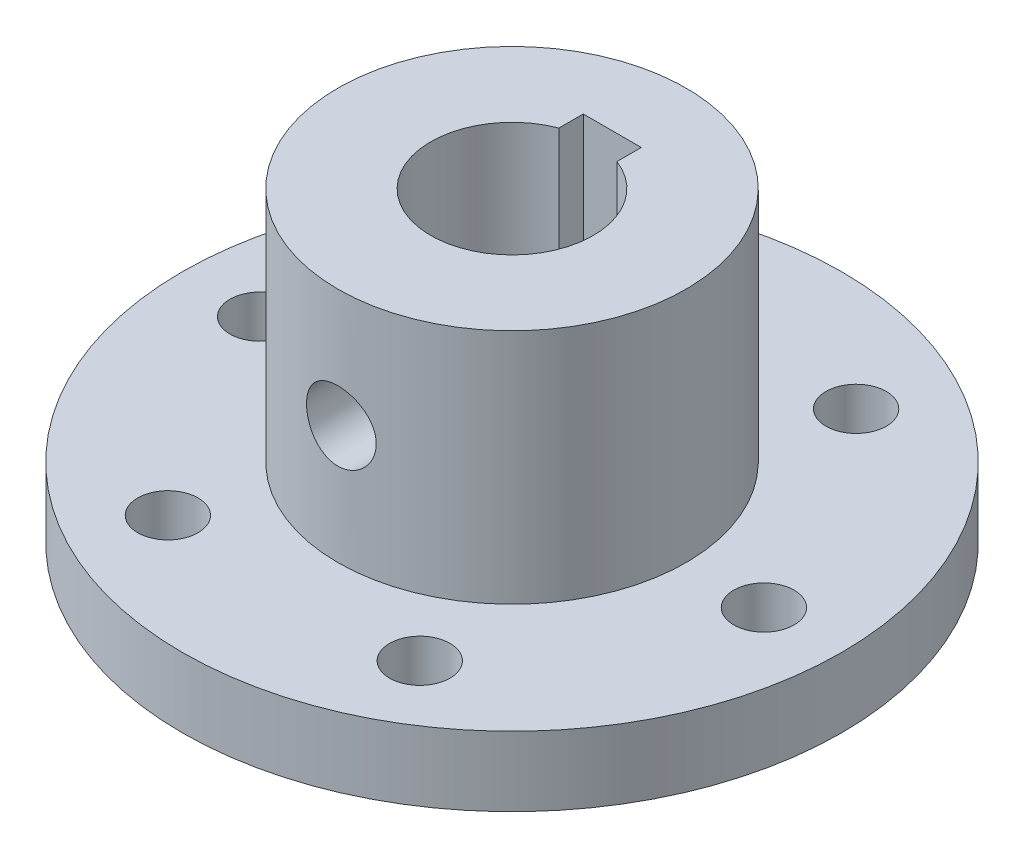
ISO-10303-21;
HEADER;
FILE_DESCRIPTION(('STEP AP214'),'2;1');
FILE_NAME('part.step','',(''),(''),'','','');
FILE_SCHEMA(('AUTOMOTIVE_DESIGN { 1 0 10303 214 1 1 1 1 }'));
ENDSEC;
DATA;
#1=APPLICATION_CONTEXT('core data for automotive mechanical design processes');
#2=APPLICATION_PROTOCOL_DEFINITION('international standard','automotive_design',2000,#1);
#3=PRODUCT_CONTEXT('',#1,'mechanical');
#4=PRODUCT('Part','Part','',(#3));
#5=PRODUCT_RELATED_PRODUCT_CATEGORY('part','',(#4));
#6=PRODUCT_DEFINITION_FORMATION('','',#4);
#7=PRODUCT_DEFINITION_CONTEXT('part definition',#1,'design');
#8=PRODUCT_DEFINITION('design','',#6,#7);
#9=PRODUCT_DEFINITION_SHAPE('','',#8);
#10=(LENGTH_UNIT() NAMED_UNIT(*) SI_UNIT(.MILLI.,.METRE.));
#11=(NAMED_UNIT(*) PLANE_ANGLE_UNIT() SI_UNIT($,.RADIAN.));
#12=(NAMED_UNIT(*) SI_UNIT($,.STERADIAN.) SOLID_ANGLE_UNIT());
#13=UNCERTAINTY_MEASURE_WITH_UNIT(LENGTH_MEASURE(1.E-05),#10,'distance_accuracy_value','');
#14=(GEOMETRIC_REPRESENTATION_CONTEXT(3) GLOBAL_UNCERTAINTY_ASSIGNED_CONTEXT((#13)) GLOBAL_UNIT_ASSIGNED_CONTEXT((#10,
#11,#12)) REPRESENTATION_CONTEXT('',''));
#15=CARTESIAN_POINT('',(0.,0.,0.));
#16=DIRECTION('',(0.,0.,1.));
#17=DIRECTION('',(1.,0.,0.));
#18=AXIS2_PLACEMENT_3D('',#15,#16,#17);
#19=CARTESIAN_POINT('',(0.,26.4,0.));
#20=DIRECTION('',(0.,-1.,0.));
#21=DIRECTION('',(0.,0.,-1.));
#22=AXIS2_PLACEMENT_3D('',#19,#20,#21);
#23=CYLINDRICAL_SURFACE('',#22,15.);
#24=CARTESIAN_POINT('',(0.,26.4,0.));
#25=DIRECTION('',(0.,1.,0.));
#26=DIRECTION('',(0.,0.,1.));
#27=AXIS2_PLACEMENT_3D('',#24,#25,#26);
#28=CIRCLE('',#27,15.);
#29=CARTESIAN_POINT('',(0.,26.4,15.));
#30=VERTEX_POINT('',#29);
#31=EDGE_CURVE('E145',#30,#30,#28,.T.);
#32=ORIENTED_EDGE('',*,*,#31,.F.);
#33=EDGE_LOOP('',(#32));
#34=FACE_BOUND('',#33,.T.);
#35=CARTESIAN_POINT('',(0.,6.,0.));
#36=DIRECTION('',(0.,1.,0.));
#37=DIRECTION('',(0.,0.,1.));
#38=AXIS2_PLACEMENT_3D('',#35,#36,#37);
#39=CIRCLE('',#38,15.);
#40=CARTESIAN_POINT('',(0.,6.,15.));
#41=VERTEX_POINT('',#40);
#42=EDGE_CURVE('E11',#41,#41,#39,.T.);
#43=ORIENTED_EDGE('',*,*,#42,.T.);
#44=EDGE_LOOP('',(#43));
#45=FACE_BOUND('',#44,.T.);
#46=CARTESIAN_POINT('',(-3.,16.2,14.6969384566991));
#47=CARTESIAN_POINT('',(-2.99999383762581,16.0333068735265,14.6969417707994));
#48=CARTESIAN_POINT('',(-2.98605951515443,15.86653613,14.6998052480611));
#49=CARTESIAN_POINT('',(-2.93073685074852,15.5377124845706,14.7109329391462));
#50=CARTESIAN_POINT('',(-2.88932654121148,15.3756634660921,14.7192014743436));
#51=CARTESIAN_POINT('',(-2.78038734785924,15.0610880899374,14.7401662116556));
#52=CARTESIAN_POINT('',(-2.71288444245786,14.9085524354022,14.7528580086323));
#53=CARTESIAN_POINT('',(-2.55374732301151,14.6169754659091,14.7812339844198));
#54=CARTESIAN_POINT('',(-2.46211445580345,14.4779333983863,14.7969179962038));
#55=CARTESIAN_POINT('',(-2.25593722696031,14.2153169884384,14.8297589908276));
#56=CARTESIAN_POINT('',(-2.14111696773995,14.0919612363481,14.8469321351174));
#57=CARTESIAN_POINT('',(-1.89242036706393,13.8661273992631,14.880674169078));
#58=CARTESIAN_POINT('',(-1.75854269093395,13.7636507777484,14.8972430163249));
#59=CARTESIAN_POINT('',(-1.47408406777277,13.5816359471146,14.9280838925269));
#60=CARTESIAN_POINT('',(-1.32336770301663,13.5023054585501,14.9423346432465));
#61=CARTESIAN_POINT('',(-1.01041245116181,13.3701751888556,14.9667521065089));
#62=CARTESIAN_POINT('',(-0.848174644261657,13.317372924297,14.9769192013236));
#63=CARTESIAN_POINT('',(-0.519050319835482,13.2404784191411,14.9919096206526));
#64=CARTESIAN_POINT('',(-0.352253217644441,13.216017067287,14.9968015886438));
#65=CARTESIAN_POINT('',(-0.0168557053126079,13.1953471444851,15.0009276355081));
#66=CARTESIAN_POINT('',(0.15174452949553,13.1991358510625,15.0001622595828));
#67=CARTESIAN_POINT('',(0.483426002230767,13.2345785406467,14.9931130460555));
#68=CARTESIAN_POINT('',(0.646551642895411,13.2658349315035,14.9869079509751));
#69=CARTESIAN_POINT('',(0.965194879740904,13.3546950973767,14.9697653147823));
#70=CARTESIAN_POINT('',(1.12071217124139,13.4122999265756,14.9588275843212));
#71=CARTESIAN_POINT('',(1.42085838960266,13.5525901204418,14.9333188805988));
#72=CARTESIAN_POINT('',(1.5654125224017,13.6354312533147,14.9187254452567));
#73=CARTESIAN_POINT('',(1.83871513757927,13.8237272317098,14.8875140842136));
#74=CARTESIAN_POINT('',(1.967461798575,13.9291846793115,14.8708959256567));
#75=CARTESIAN_POINT('',(2.20785429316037,14.1619008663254,14.8371289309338));
#76=CARTESIAN_POINT('',(2.31916294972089,14.2895075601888,14.8199758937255));
#77=CARTESIAN_POINT('',(2.51885547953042,14.5617493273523,14.7873471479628));
#78=CARTESIAN_POINT('',(2.60723891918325,14.7063847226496,14.7718714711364));
#79=CARTESIAN_POINT('',(2.75868844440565,15.0090624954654,14.7443414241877));
#80=CARTESIAN_POINT('',(2.82169994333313,15.167132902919,14.7322944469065));
#81=CARTESIAN_POINT('',(2.92017102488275,15.491913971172,14.7130942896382));
#82=CARTESIAN_POINT('',(2.95563419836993,15.6586235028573,14.7059404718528));
#83=CARTESIAN_POINT('',(2.99749801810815,15.9928945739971,14.6974643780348));
#84=CARTESIAN_POINT('',(3.00438557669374,16.160392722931,14.6960444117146));
#85=CARTESIAN_POINT('',(2.99021288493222,16.494144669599,14.6989345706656));
#86=CARTESIAN_POINT('',(2.96915421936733,16.6603985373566,14.7032443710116));
#87=CARTESIAN_POINT('',(2.90010662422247,16.9853059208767,14.7170169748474));
#88=CARTESIAN_POINT('',(2.8523778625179,17.1440170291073,14.7264299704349));
#89=CARTESIAN_POINT('',(2.73162310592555,17.4511898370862,14.7493046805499));
#90=CARTESIAN_POINT('',(2.65859502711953,17.5996506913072,14.7627667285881));
#91=CARTESIAN_POINT('',(2.48821242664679,17.8842393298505,14.7924421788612));
#92=CARTESIAN_POINT('',(2.39055323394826,18.0201811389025,14.8086891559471));
#93=CARTESIAN_POINT('',(2.17408671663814,18.2739249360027,14.8420117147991));
#94=CARTESIAN_POINT('',(2.05527721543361,18.3917250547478,14.8590873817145));
#95=CARTESIAN_POINT('',(1.79769682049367,18.6076876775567,14.8924603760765));
#96=CARTESIAN_POINT('',(1.65864749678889,18.70552096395,14.9087417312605));
#97=CARTESIAN_POINT('',(1.36580368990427,18.8764376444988,14.9384138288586));
#98=CARTESIAN_POINT('',(1.21200982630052,18.9495220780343,14.9518046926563));
#99=CARTESIAN_POINT('',(0.894908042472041,19.0683866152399,14.974118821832));
#100=CARTESIAN_POINT('',(0.731660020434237,19.1143215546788,14.9830673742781));
#101=CARTESIAN_POINT('',(0.399568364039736,19.1780737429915,14.9955970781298));
#102=CARTESIAN_POINT('',(0.230725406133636,19.195894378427,14.9991788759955));
#103=CARTESIAN_POINT('',(-0.104618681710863,19.2027809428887,15.0005562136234));
#104=CARTESIAN_POINT('',(-0.271109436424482,19.1923418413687,14.9984513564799));
#105=CARTESIAN_POINT('',(-0.599913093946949,19.1440981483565,14.9889013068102));
#106=CARTESIAN_POINT('',(-0.762226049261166,19.1062939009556,14.9814561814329));
#107=CARTESIAN_POINT('',(-1.07775824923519,19.0046130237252,14.9620649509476));
#108=CARTESIAN_POINT('',(-1.23099732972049,18.9407958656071,14.9501291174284));
#109=CARTESIAN_POINT('',(-1.52466366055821,18.7889632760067,14.9230416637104));
#110=CARTESIAN_POINT('',(-1.66508989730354,18.7009459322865,14.9078897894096));
#111=CARTESIAN_POINT('',(-1.93159167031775,18.5015418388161,14.8757279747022));
#112=CARTESIAN_POINT('',(-2.05739914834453,18.3898009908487,14.858692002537));
#113=CARTESIAN_POINT('',(-2.28864785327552,18.1468492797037,14.8248366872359));
#114=CARTESIAN_POINT('',(-2.39408424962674,18.0156338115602,14.8080173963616));
#115=CARTESIAN_POINT('',(-2.58267665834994,17.7357620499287,14.7763002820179));
#116=CARTESIAN_POINT('',(-2.66558044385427,17.5869331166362,14.7614251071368));
#117=CARTESIAN_POINT('',(-2.80507214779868,17.2772016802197,14.7355571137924));
#118=CARTESIAN_POINT('',(-2.86168393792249,17.1163102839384,14.7245607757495));
#119=CARTESIAN_POINT('',(-2.93600741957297,16.8292126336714,14.7098904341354));
#120=CARTESIAN_POINT('',(-2.95996169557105,16.7046437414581,14.7050635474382));
#121=CARTESIAN_POINT('',(-2.99196005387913,16.4533981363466,14.6985863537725));
#122=CARTESIAN_POINT('',(-3.00000468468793,16.3267214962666,14.6969359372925));
#123=CARTESIAN_POINT('',(-3.,16.2,14.6969384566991));
#124=B_SPLINE_CURVE_WITH_KNOTS('',3,(#46,#47,#48,#49,#50,#51,#52,#53,#54,#55,#56,#57,#58,#59,
#60,#61,#62,#63,#64,#65,#66,#67,#68,#69,#70,#71,#72,#73,#74,#75,#76,#77,#78,#79,#80,#81,#82,#83,
#84,#85,#86,#87,#88,#89,#90,#91,#92,#93,#94,#95,#96,#97,#98,#99,#100,#101,#102,#103,#104,#105,
#106,#107,#108,#109,#110,#111,#112,#113,#114,#115,#116,#117,#118,#119,#120,#121,#122,#123),
.UNSPECIFIED.,.T.,.F.,(4,2,2,2,2,2,2,2,2,2,2,2,2,2,2,2,2,2,2,2,2,2,2,2,2,2,2,2,2,2,2,2,2,2,2,2,
2,2,4),(0.,0.499615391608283,0.999630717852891,1.49914949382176,1.99864039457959,
2.50446757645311,3.01033020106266,3.52060201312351,4.03082604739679,4.53432746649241,
5.03778036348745,5.53406368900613,6.03036687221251,6.5297977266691,7.02928607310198,
7.5374804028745,8.04568434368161,8.5549758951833,9.06420105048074,9.5647127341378,
10.0651960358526,10.5608802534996,11.056605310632,11.5587917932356,12.0610299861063,
12.5709780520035,13.0809046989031,13.5878944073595,14.0948230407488,14.5929305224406,
15.0910317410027,15.5880005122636,16.0850085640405,16.5900345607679,17.0951801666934,
17.6057669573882,18.1158892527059,18.4957141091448,18.8755258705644),.UNSPECIFIED.);
#125=CARTESIAN_POINT('',(-3.,16.2,14.6969384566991));
#126=VERTEX_POINT('',#125);
#127=EDGE_CURVE('E123',#126,#126,#124,.T.);
#128=ORIENTED_EDGE('',*,*,#127,.F.);
#129=EDGE_LOOP('',(#128));
#130=FACE_BOUND('',#129,.T.);
#131=ADVANCED_FACE('F45',(#34,#45,#130),#23,.T.);
#132=CARTESIAN_POINT('',(0.,0.,0.));
#133=DIRECTION('',(0.,1.,0.));
#134=DIRECTION('',(0.,0.,1.));
#135=AXIS2_PLACEMENT_3D('',#132,#133,#134);
#136=CYLINDRICAL_SURFACE('',#135,7.);
#137=CARTESIAN_POINT('',(0.,26.4,0.));
#138=DIRECTION('',(0.,1.,0.));
#139=DIRECTION('',(0.,0.,1.));
#140=AXIS2_PLACEMENT_3D('',#137,#138,#139);
#141=CIRCLE('',#140,7.);
#142=CARTESIAN_POINT('',(-2.5,26.4,-6.53834841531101));
#143=VERTEX_POINT('',#142);
#144=CARTESIAN_POINT('',(2.5,26.4,-6.53834841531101));
#145=VERTEX_POINT('',#144);
#146=EDGE_CURVE('E136',#143,#145,#141,.T.);
#147=ORIENTED_EDGE('',*,*,#146,.T.);
#148=DIRECTION('',(0.,1.,0.));
#149=VECTOR('',#148,1.);
#150=CARTESIAN_POINT('',(2.5,0.,-6.53834841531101));
#151=LINE('',#150,#149);
#152=CARTESIAN_POINT('',(2.5,0.,-6.53834841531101));
#153=VERTEX_POINT('',#152);
#154=EDGE_CURVE('E102',#153,#145,#151,.T.);
#155=ORIENTED_EDGE('',*,*,#154,.F.);
#156=CARTESIAN_POINT('',(0.,0.,0.));
#157=DIRECTION('',(0.,1.,0.));
#158=DIRECTION('',(0.,0.,1.));
#159=AXIS2_PLACEMENT_3D('',#156,#157,#158);
#160=CIRCLE('',#159,7.);
#161=CARTESIAN_POINT('',(-2.5,0.,-6.53834841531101));
#162=VERTEX_POINT('',#161);
#163=EDGE_CURVE('E106',#162,#153,#160,.T.);
#164=ORIENTED_EDGE('',*,*,#163,.F.);
#165=DIRECTION('',(0.,1.,0.));
#166=VECTOR('',#165,1.);
#167=CARTESIAN_POINT('',(-2.5,0.,-6.53834841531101));
#168=LINE('',#167,#166);
#169=EDGE_CURVE('E92',#162,#143,#168,.T.);
#170=ORIENTED_EDGE('',*,*,#169,.T.);
#171=EDGE_LOOP('',(#147,#155,#164,#170));
#172=FACE_BOUND('',#171,.T.);
#173=CARTESIAN_POINT('',(-3.,16.2,6.32455532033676));
#174=CARTESIAN_POINT('',(-2.99999904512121,16.2798007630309,6.32455623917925));
#175=CARTESIAN_POINT('',(-2.99680914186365,16.3596308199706,6.32607259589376));
#176=CARTESIAN_POINT('',(-2.98409481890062,16.5186868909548,6.33207844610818));
#177=CARTESIAN_POINT('',(-2.97456636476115,16.5979124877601,6.33656983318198));
#178=CARTESIAN_POINT('',(-2.93654933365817,16.8340890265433,6.35433138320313));
#179=CARTESIAN_POINT('',(-2.8986294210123,16.9893199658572,6.3718883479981));
#180=CARTESIAN_POINT('',(-2.79949691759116,17.2898703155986,6.41604959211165));
#181=CARTESIAN_POINT('',(-2.73838302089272,17.4352286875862,6.44261548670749));
#182=CARTESIAN_POINT('',(-2.59488993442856,17.7136255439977,6.50173461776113));
#183=CARTESIAN_POINT('',(-2.51251491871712,17.8466664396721,6.53428667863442));
#184=CARTESIAN_POINT('',(-2.32303426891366,18.1054528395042,6.604111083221));
#185=CARTESIAN_POINT('',(-2.21474428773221,18.2302862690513,6.64154929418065));
#186=CARTESIAN_POINT('',(-1.97899162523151,18.4607018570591,6.71556787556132));
#187=CARTESIAN_POINT('',(-1.85152133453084,18.5662763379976,6.75214789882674));
#188=CARTESIAN_POINT('',(-1.5737748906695,18.7599192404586,6.82236442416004));
#189=CARTESIAN_POINT('',(-1.42271545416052,18.8469492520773,6.85578586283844));
#190=CARTESIAN_POINT('',(-1.10640716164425,18.9939641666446,6.91387422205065));
#191=CARTESIAN_POINT('',(-0.941164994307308,19.0539617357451,6.93854524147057));
#192=CARTESIAN_POINT('',(-0.61076426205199,19.141865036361,6.97517471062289));
#193=CARTESIAN_POINT('',(-0.446095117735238,19.1713460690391,6.98775448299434));
#194=CARTESIAN_POINT('',(-0.113699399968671,19.2024826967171,7.00104925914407));
#195=CARTESIAN_POINT('',(0.0540258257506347,19.204150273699,7.00176937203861));
#196=CARTESIAN_POINT('',(0.376268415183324,19.1804097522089,6.99162033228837));
#197=CARTESIAN_POINT('',(0.530941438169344,19.1567362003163,6.98149359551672));
#198=CARTESIAN_POINT('',(0.833871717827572,19.0859759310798,6.95182205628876));
#199=CARTESIAN_POINT('',(0.982128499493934,19.0388874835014,6.93227655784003));
#200=CARTESIAN_POINT('',(1.27075797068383,18.9220934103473,6.88526693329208));
#201=CARTESIAN_POINT('',(1.41097529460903,18.8520527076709,6.85768620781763));
#202=CARTESIAN_POINT('',(1.67803533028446,18.6916826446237,6.79727675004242));
#203=CARTESIAN_POINT('',(1.8048732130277,18.6013459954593,6.76444613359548));
#204=CARTESIAN_POINT('',(2.05154784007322,18.395190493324,6.69393790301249));
#205=CARTESIAN_POINT('',(2.1701729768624,18.277981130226,6.65608139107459));
#206=CARTESIAN_POINT('',(2.38662617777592,18.0252971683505,6.5815763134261));
#207=CARTESIAN_POINT('',(2.48444526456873,17.8898147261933,6.5449282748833));
#208=CARTESIAN_POINT('',(2.65987942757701,17.5982201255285,6.47566835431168));
#209=CARTESIAN_POINT('',(2.73662769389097,17.4415358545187,6.44325238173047));
#210=CARTESIAN_POINT('',(2.86214771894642,17.1157109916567,6.3884939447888));
#211=CARTESIAN_POINT('',(2.9109408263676,16.946580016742,6.36614379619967));
#212=CARTESIAN_POINT('',(2.9759867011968,16.6128272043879,6.33598550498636));
#213=CARTESIAN_POINT('',(2.99421280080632,16.4486710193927,6.32729797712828));
#214=CARTESIAN_POINT('',(3.00343131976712,16.1194510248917,6.32292988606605));
#215=CARTESIAN_POINT('',(2.99443410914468,15.9543875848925,6.32724437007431));
#216=CARTESIAN_POINT('',(2.9512647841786,15.6401374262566,6.34748143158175));
#217=CARTESIAN_POINT('',(2.9188846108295,15.4906442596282,6.36257694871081));
#218=CARTESIAN_POINT('',(2.83228012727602,15.1993545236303,6.40159573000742));
#219=CARTESIAN_POINT('',(2.77805051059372,15.0575598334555,6.42552113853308));
#220=CARTESIAN_POINT('',(2.64668378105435,14.7787901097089,6.48076667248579));
#221=CARTESIAN_POINT('',(2.5686531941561,14.642292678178,6.51236308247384));
#222=CARTESIAN_POINT('',(2.39277124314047,14.3836492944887,6.57901833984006));
#223=CARTESIAN_POINT('',(2.29491096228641,14.2615098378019,6.61407874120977));
#224=CARTESIAN_POINT('',(2.07211495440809,14.0239710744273,6.68739396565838));
#225=CARTESIAN_POINT('',(1.94556360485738,13.9100847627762,6.72566111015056));
#226=CARTESIAN_POINT('',(1.67428466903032,13.7048657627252,6.79826947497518));
#227=CARTESIAN_POINT('',(1.5295552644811,13.6135353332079,6.83261030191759));
#228=CARTESIAN_POINT('',(1.2245807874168,13.4559173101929,6.89381439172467));
#229=CARTESIAN_POINT('',(1.06426298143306,13.3897549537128,6.92064008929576));
#230=CARTESIAN_POINT('',(0.733319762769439,13.2858502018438,6.96347660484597));
#231=CARTESIAN_POINT('',(0.562700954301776,13.2480898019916,6.9794942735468));
#232=CARTESIAN_POINT('',(0.229480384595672,13.2044225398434,6.99808081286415));
#233=CARTESIAN_POINT('',(0.0672060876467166,13.1963861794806,7.00154837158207));
#234=CARTESIAN_POINT('',(-0.256339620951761,13.2065955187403,6.99717401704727));
#235=CARTESIAN_POINT('',(-0.417611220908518,13.224836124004,6.98933429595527));
#236=CARTESIAN_POINT('',(-0.728044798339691,13.2855535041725,6.96371224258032));
#237=CARTESIAN_POINT('',(-0.877433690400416,13.3270538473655,6.9463310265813));
#238=CARTESIAN_POINT('',(-1.16704890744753,13.4320161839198,6.90358200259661));
#239=CARTESIAN_POINT('',(-1.30727354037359,13.4954822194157,6.87821272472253));
#240=CARTESIAN_POINT('',(-1.58164154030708,13.645789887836,6.82048100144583));
#241=CARTESIAN_POINT('',(-1.71521554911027,13.7335659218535,6.78785230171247));
#242=CARTESIAN_POINT('',(-1.96631980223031,13.9286817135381,6.71941601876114));
#243=CARTESIAN_POINT('',(-2.08384366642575,14.0360292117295,6.68360718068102));
#244=CARTESIAN_POINT('',(-2.30839582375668,14.2763838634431,6.60956029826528));
#245=CARTESIAN_POINT('',(-2.41404185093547,14.410688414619,6.57133471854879));
#246=CARTESIAN_POINT('',(-2.60157161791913,14.6963461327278,6.49938146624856));
#247=CARTESIAN_POINT('',(-2.68344152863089,14.8477091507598,6.46565641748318));
#248=CARTESIAN_POINT('',(-2.78618250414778,15.0843824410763,6.42172587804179));
#249=CARTESIAN_POINT('',(-2.81707998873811,15.164855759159,6.40819457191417));
#250=CARTESIAN_POINT('',(-2.87192428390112,15.3285162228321,6.38380411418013));
#251=CARTESIAN_POINT('',(-2.89587453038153,15.4117020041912,6.37294364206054));
#252=CARTESIAN_POINT('',(-2.93649221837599,15.5799308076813,6.35433014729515));
#253=CARTESIAN_POINT('',(-2.95317884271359,15.664968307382,6.3465689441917));
#254=CARTESIAN_POINT('',(-2.97913893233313,15.8363627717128,6.33442493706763));
#255=CARTESIAN_POINT('',(-2.9884180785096,15.9227186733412,6.33003954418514));
#256=CARTESIAN_POINT('',(-2.99595579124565,16.0410614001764,6.32647229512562));
#257=CARTESIAN_POINT('',(-2.99747183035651,16.0728242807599,6.32575401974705));
#258=CARTESIAN_POINT('',(-2.99949413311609,16.1363898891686,6.3247953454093));
#259=CARTESIAN_POINT('',(-3.00000038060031,16.1681926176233,6.32455495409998));
#260=CARTESIAN_POINT('',(-3.,16.2,6.32455532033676));
#261=B_SPLINE_CURVE_WITH_KNOTS('',3,(#173,#174,#175,#176,#177,#178,#179,#180,#181,#182,#183,
#184,#185,#186,#187,#188,#189,#190,#191,#192,#193,#194,#195,#196,#197,#198,#199,#200,#201,#202,
#203,#204,#205,#206,#207,#208,#209,#210,#211,#212,#213,#214,#215,#216,#217,#218,#219,#220,#221,
#222,#223,#224,#225,#226,#227,#228,#229,#230,#231,#232,#233,#234,#235,#236,#237,#238,#239,#240,
#241,#242,#243,#244,#245,#246,#247,#248,#249,#250,#251,#252,#253,#254,#255,#256,#257,#258,#259,
#260),.UNSPECIFIED.,.T.,.F.,(4,2,2,2,2,2,2,2,2,2,2,2,2,2,2,2,2,2,2,2,2,2,2,2,2,2,2,2,2,2,2,2,2,
2,2,2,2,2,2,2,2,2,2,4),(0.,0.239366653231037,0.478885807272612,0.958574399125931,
1.43624431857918,1.91382053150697,2.41995684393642,2.92629448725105,3.45610451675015,
3.98566604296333,4.48627308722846,4.98666446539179,5.45487182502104,5.92311378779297,
6.39852111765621,6.8740994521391,7.38485137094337,7.89582322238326,8.42542768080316,
8.95462715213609,9.44812252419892,9.94142993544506,10.4004743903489,10.8596303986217,
11.3387499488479,11.8180854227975,12.3391595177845,12.8602857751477,13.3839722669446,
13.9073265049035,14.3923682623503,14.8773159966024,15.3432850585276,15.8093399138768,
16.2966585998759,16.784170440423,17.3070906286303,17.8303143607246,18.0917878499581,
18.3531318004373,18.6137813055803,18.8742307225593,18.9696371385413,19.0650450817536),.UNSPECIFIED.);
#262=CARTESIAN_POINT('',(-3.,16.2,6.32455532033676));
#263=VERTEX_POINT('',#262);
#264=EDGE_CURVE('E49',#263,#263,#261,.T.);
#265=ORIENTED_EDGE('',*,*,#264,.F.);
#266=EDGE_LOOP('',(#265));
#267=FACE_BOUND('',#266,.T.);
#268=ADVANCED_FACE('F107',(#172,#267),#136,.F.);
#269=CARTESIAN_POINT('',(0.,6.,0.));
#270=DIRECTION('',(0.,-1.,0.));
#271=DIRECTION('',(0.,0.,-1.));
#272=AXIS2_PLACEMENT_3D('',#269,#270,#271);
#273=CYLINDRICAL_SURFACE('',#272,28.4);
#274=CARTESIAN_POINT('',(0.,6.,0.));
#275=DIRECTION('',(0.,1.,0.));
#276=DIRECTION('',(0.,0.,1.));
#277=AXIS2_PLACEMENT_3D('',#274,#275,#276);
#278=CIRCLE('',#277,28.4);
#279=CARTESIAN_POINT('',(0.,6.,28.4));
#280=VERTEX_POINT('',#279);
#281=EDGE_CURVE('E60',#280,#280,#278,.T.);
#282=ORIENTED_EDGE('',*,*,#281,.F.);
#283=EDGE_LOOP('',(#282));
#284=FACE_BOUND('',#283,.T.);
#285=CARTESIAN_POINT('',(0.,0.,0.));
#286=DIRECTION('',(0.,1.,0.));
#287=DIRECTION('',(0.,0.,1.));
#288=AXIS2_PLACEMENT_3D('',#285,#286,#287);
#289=CIRCLE('',#288,28.4);
#290=CARTESIAN_POINT('',(0.,0.,28.4));
#291=VERTEX_POINT('',#290);
#292=EDGE_CURVE('E153',#291,#291,#289,.T.);
#293=ORIENTED_EDGE('',*,*,#292,.T.);
#294=EDGE_LOOP('',(#293));
#295=FACE_BOUND('',#294,.T.);
#296=ADVANCED_FACE('F47',(#284,#295),#273,.T.);
#297=CARTESIAN_POINT('',(0.,6.,0.));
#298=DIRECTION('',(0.,1.,0.));
#299=DIRECTION('',(0.,0.,1.));
#300=AXIS2_PLACEMENT_3D('',#297,#298,#299);
#301=PLANE('',#300);
#302=CARTESIAN_POINT('',(-10.8500000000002,6.,-18.7927512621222));
#303=DIRECTION('',(0.,1.,0.));
#304=DIRECTION('',(-0.866025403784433,0.,0.50000000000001));
#305=AXIS2_PLACEMENT_3D('',#302,#303,#304);
#306=CIRCLE('',#305,2.6);
#307=CARTESIAN_POINT('',(-13.1016660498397,6.,-17.4927512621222));
#308=VERTEX_POINT('',#307);
#309=EDGE_CURVE('E257',#308,#308,#306,.T.);
#310=ORIENTED_EDGE('',*,*,#309,.F.);
#311=EDGE_LOOP('',(#310));
#312=FACE_BOUND('',#311,.T.);
#313=CARTESIAN_POINT('',(10.8499999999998,6.,-18.7927512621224));
#314=DIRECTION('',(0.,1.,0.));
#315=DIRECTION('',(-0.866025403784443,0.,-0.499999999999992));
#316=AXIS2_PLACEMENT_3D('',#313,#314,#315);
#317=CIRCLE('',#316,2.6);
#318=CARTESIAN_POINT('',(8.59833395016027,6.,-20.0927512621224));
#319=VERTEX_POINT('',#318);
#320=EDGE_CURVE('E250',#319,#319,#317,.T.);
#321=ORIENTED_EDGE('',*,*,#320,.F.);
#322=EDGE_LOOP('',(#321));
#323=FACE_BOUND('',#322,.T.);
#324=CARTESIAN_POINT('',(21.7,6.,0.));
#325=DIRECTION('',(0.,1.,0.));
#326=DIRECTION('',(0.,0.,-1.));
#327=AXIS2_PLACEMENT_3D('',#324,#325,#326);
#328=CIRCLE('',#327,2.6);
#329=CARTESIAN_POINT('',(21.7,6.,-2.6));
#330=VERTEX_POINT('',#329);
#331=EDGE_CURVE('E240',#330,#330,#328,.T.);
#332=ORIENTED_EDGE('',*,*,#331,.F.);
#333=EDGE_LOOP('',(#332));
#334=FACE_BOUND('',#333,.T.);
#335=CARTESIAN_POINT('',(10.8500000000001,6.,18.7927512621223));
#336=DIRECTION('',(0.,1.,0.));
#337=DIRECTION('',(0.866025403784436,0.,-0.500000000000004));
#338=AXIS2_PLACEMENT_3D('',#335,#336,#337);
#339=CIRCLE('',#338,2.6);
#340=CARTESIAN_POINT('',(13.1016660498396,6.,17.4927512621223));
#341=VERTEX_POINT('',#340);
#342=EDGE_CURVE('E230',#341,#341,#339,.T.);
#343=ORIENTED_EDGE('',*,*,#342,.F.);
#344=EDGE_LOOP('',(#343));
#345=FACE_BOUND('',#344,.T.);
#346=CARTESIAN_POINT('',(-10.85,6.,18.7927512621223));
#347=DIRECTION('',(0.,1.,0.));
#348=DIRECTION('',(0.86602540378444,0.,0.499999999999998));
#349=AXIS2_PLACEMENT_3D('',#346,#347,#348);
#350=CIRCLE('',#349,2.6);
#351=CARTESIAN_POINT('',(-8.59833395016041,6.,20.0927512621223));
#352=VERTEX_POINT('',#351);
#353=EDGE_CURVE('E237',#352,#352,#350,.T.);
#354=ORIENTED_EDGE('',*,*,#353,.F.);
#355=EDGE_LOOP('',(#354));
#356=FACE_BOUND('',#355,.T.);
#357=CARTESIAN_POINT('',(-21.7,6.,0.));
#358=DIRECTION('',(0.,1.,0.));
#359=DIRECTION('',(0.,0.,1.));
#360=AXIS2_PLACEMENT_3D('',#357,#358,#359);
#361=CIRCLE('',#360,2.6);
#362=CARTESIAN_POINT('',(-21.7,6.,2.6));
#363=VERTEX_POINT('',#362);
#364=EDGE_CURVE('E265',#363,#363,#361,.T.);
#365=ORIENTED_EDGE('',*,*,#364,.F.);
#366=EDGE_LOOP('',(#365));
#367=FACE_BOUND('',#366,.T.);
#368=ORIENTED_EDGE('',*,*,#42,.F.);
#369=EDGE_LOOP('',(#368));
#370=FACE_BOUND('',#369,.T.);
#371=ORIENTED_EDGE('',*,*,#281,.T.);
#372=EDGE_LOOP('',(#371));
#373=FACE_BOUND('',#372,.T.);
#374=ADVANCED_FACE('F163',(#312,#323,#334,#345,#356,#367,#370,#373),#301,.T.);
#375=CARTESIAN_POINT('',(0.,0.,0.));
#376=DIRECTION('',(0.,1.,0.));
#377=DIRECTION('',(0.,0.,1.));
#378=AXIS2_PLACEMENT_3D('',#375,#376,#377);
#379=PLANE('',#378);
#380=CARTESIAN_POINT('',(-10.8500000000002,0.,-18.7927512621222));
#381=DIRECTION('',(0.,1.,0.));
#382=DIRECTION('',(-0.866025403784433,0.,0.50000000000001));
#383=AXIS2_PLACEMENT_3D('',#380,#381,#382);
#384=CIRCLE('',#383,2.6);
#385=CARTESIAN_POINT('',(-13.1016660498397,0.,-17.4927512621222));
#386=VERTEX_POINT('',#385);
#387=EDGE_CURVE('E254',#386,#386,#384,.T.);
#388=ORIENTED_EDGE('',*,*,#387,.T.);
#389=EDGE_LOOP('',(#388));
#390=FACE_BOUND('',#389,.T.);
#391=CARTESIAN_POINT('',(10.8499999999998,0.,-18.7927512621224));
#392=DIRECTION('',(0.,1.,0.));
#393=DIRECTION('',(-0.866025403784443,0.,-0.499999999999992));
#394=AXIS2_PLACEMENT_3D('',#391,#392,#393);
#395=CIRCLE('',#394,2.6);
#396=CARTESIAN_POINT('',(8.59833395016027,0.,-20.0927512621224));
#397=VERTEX_POINT('',#396);
#398=EDGE_CURVE('E246',#397,#397,#395,.T.);
#399=ORIENTED_EDGE('',*,*,#398,.T.);
#400=EDGE_LOOP('',(#399));
#401=FACE_BOUND('',#400,.T.);
#402=CARTESIAN_POINT('',(21.7,0.,0.));
#403=DIRECTION('',(0.,1.,0.));
#404=DIRECTION('',(0.,0.,-1.));
#405=AXIS2_PLACEMENT_3D('',#402,#403,#404);
#406=CIRCLE('',#405,2.6);
#407=CARTESIAN_POINT('',(21.7,0.,-2.6));
#408=VERTEX_POINT('',#407);
#409=EDGE_CURVE('E233',#408,#408,#406,.T.);
#410=ORIENTED_EDGE('',*,*,#409,.T.);
#411=EDGE_LOOP('',(#410));
#412=FACE_BOUND('',#411,.T.);
#413=CARTESIAN_POINT('',(10.8500000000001,0.,18.7927512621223));
#414=DIRECTION('',(0.,1.,0.));
#415=DIRECTION('',(0.866025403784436,0.,-0.500000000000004));
#416=AXIS2_PLACEMENT_3D('',#413,#414,#415);
#417=CIRCLE('',#416,2.6);
#418=CARTESIAN_POINT('',(13.1016660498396,0.,17.4927512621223));
#419=VERTEX_POINT('',#418);
#420=EDGE_CURVE('E227',#419,#419,#417,.T.);
#421=ORIENTED_EDGE('',*,*,#420,.T.);
#422=EDGE_LOOP('',(#421));
#423=FACE_BOUND('',#422,.T.);
#424=CARTESIAN_POINT('',(-10.85,0.,18.7927512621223));
#425=DIRECTION('',(0.,1.,0.));
#426=DIRECTION('',(0.86602540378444,0.,0.499999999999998));
#427=AXIS2_PLACEMENT_3D('',#424,#425,#426);
#428=CIRCLE('',#427,2.6);
#429=CARTESIAN_POINT('',(-8.59833395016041,0.,20.0927512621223));
#430=VERTEX_POINT('',#429);
#431=EDGE_CURVE('E261',#430,#430,#428,.T.);
#432=ORIENTED_EDGE('',*,*,#431,.T.);
#433=EDGE_LOOP('',(#432));
#434=FACE_BOUND('',#433,.T.);
#435=CARTESIAN_POINT('',(-21.7,0.,0.));
#436=DIRECTION('',(0.,1.,0.));
#437=DIRECTION('',(0.,0.,1.));
#438=AXIS2_PLACEMENT_3D('',#435,#436,#437);
#439=CIRCLE('',#438,2.6);
#440=CARTESIAN_POINT('',(-21.7,0.,2.6));
#441=VERTEX_POINT('',#440);
#442=EDGE_CURVE('E269',#441,#441,#439,.T.);
#443=ORIENTED_EDGE('',*,*,#442,.T.);
#444=EDGE_LOOP('',(#443));
#445=FACE_BOUND('',#444,.T.);
#446=DIRECTION('',(-1.,0.,0.));
#447=VECTOR('',#446,1.);
#448=CARTESIAN_POINT('',(-2.5,0.,-8.63834841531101));
#449=LINE('',#448,#447);
#450=CARTESIAN_POINT('',(2.5,0.,-8.63834841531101));
#451=VERTEX_POINT('',#450);
#452=CARTESIAN_POINT('',(-2.5,0.,-8.63834841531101));
#453=VERTEX_POINT('',#452);
#454=EDGE_CURVE('E103',#451,#453,#449,.T.);
#455=ORIENTED_EDGE('',*,*,#454,.T.);
#456=DIRECTION('',(0.,0.,1.));
#457=VECTOR('',#456,1.);
#458=CARTESIAN_POINT('',(-2.5,0.,-8.63834841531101));
#459=LINE('',#458,#457);
#460=EDGE_CURVE('E96',#453,#162,#459,.T.);
#461=ORIENTED_EDGE('',*,*,#460,.T.);
#462=ORIENTED_EDGE('',*,*,#163,.T.);
#463=DIRECTION('',(0.,0.,-1.));
#464=VECTOR('',#463,1.);
#465=CARTESIAN_POINT('',(2.5,0.,-8.63834841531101));
#466=LINE('',#465,#464);
#467=EDGE_CURVE('E68',#153,#451,#466,.T.);
#468=ORIENTED_EDGE('',*,*,#467,.T.);
#469=EDGE_LOOP('',(#455,#461,#462,#468));
#470=FACE_BOUND('',#469,.T.);
#471=ORIENTED_EDGE('',*,*,#292,.F.);
#472=EDGE_LOOP('',(#471));
#473=FACE_BOUND('',#472,.T.);
#474=ADVANCED_FACE('F112',(#390,#401,#412,#423,#434,#445,#470,#473),#379,.F.);
#475=CARTESIAN_POINT('',(0.,26.4,0.));
#476=DIRECTION('',(0.,1.,0.));
#477=DIRECTION('',(0.,0.,1.));
#478=AXIS2_PLACEMENT_3D('',#475,#476,#477);
#479=PLANE('',#478);
#480=DIRECTION('',(0.,0.,1.));
#481=VECTOR('',#480,1.);
#482=CARTESIAN_POINT('',(-2.5,26.4,-8.63834841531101));
#483=LINE('',#482,#481);
#484=CARTESIAN_POINT('',(-2.5,26.4,-8.63834841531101));
#485=VERTEX_POINT('',#484);
#486=EDGE_CURVE('E76',#485,#143,#483,.T.);
#487=ORIENTED_EDGE('',*,*,#486,.F.);
#488=DIRECTION('',(-1.,0.,0.));
#489=VECTOR('',#488,1.);
#490=CARTESIAN_POINT('',(-2.5,26.4,-8.63834841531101));
#491=LINE('',#490,#489);
#492=CARTESIAN_POINT('',(2.5,26.4,-8.63834841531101));
#493=VERTEX_POINT('',#492);
#494=EDGE_CURVE('E116',#493,#485,#491,.T.);
#495=ORIENTED_EDGE('',*,*,#494,.F.);
#496=DIRECTION('',(0.,0.,-1.));
#497=VECTOR('',#496,1.);
#498=CARTESIAN_POINT('',(2.5,26.4,-8.63834841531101));
#499=LINE('',#498,#497);
#500=EDGE_CURVE('E120',#145,#493,#499,.T.);
#501=ORIENTED_EDGE('',*,*,#500,.F.);
#502=ORIENTED_EDGE('',*,*,#146,.F.);
#503=EDGE_LOOP('',(#487,#495,#501,#502));
#504=FACE_BOUND('',#503,.T.);
#505=ORIENTED_EDGE('',*,*,#31,.T.);
#506=EDGE_LOOP('',(#505));
#507=FACE_BOUND('',#506,.T.);
#508=ADVANCED_FACE('F162',(#504,#507),#479,.T.);
#509=CARTESIAN_POINT('',(-2.5,0.,-8.63834841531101));
#510=DIRECTION('',(-1.,0.,0.));
#511=DIRECTION('',(0.,0.,1.));
#512=AXIS2_PLACEMENT_3D('',#509,#510,#511);
#513=PLANE('',#512);
#514=ORIENTED_EDGE('',*,*,#486,.T.);
#515=ORIENTED_EDGE('',*,*,#169,.F.);
#516=ORIENTED_EDGE('',*,*,#460,.F.);
#517=DIRECTION('',(0.,1.,0.));
#518=VECTOR('',#517,1.);
#519=CARTESIAN_POINT('',(-2.5,0.,-8.63834841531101));
#520=LINE('',#519,#518);
#521=EDGE_CURVE('E142',#453,#485,#520,.T.);
#522=ORIENTED_EDGE('',*,*,#521,.T.);
#523=EDGE_LOOP('',(#514,#515,#516,#522));
#524=FACE_BOUND('',#523,.T.);
#525=ADVANCED_FACE('F94',(#524),#513,.F.);
#526=CARTESIAN_POINT('',(-2.5,0.,-8.63834841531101));
#527=DIRECTION('',(0.,0.,-1.));
#528=DIRECTION('',(-1.,0.,0.));
#529=AXIS2_PLACEMENT_3D('',#526,#527,#528);
#530=PLANE('',#529);
#531=ORIENTED_EDGE('',*,*,#494,.T.);
#532=ORIENTED_EDGE('',*,*,#521,.F.);
#533=ORIENTED_EDGE('',*,*,#454,.F.);
#534=DIRECTION('',(0.,1.,0.));
#535=VECTOR('',#534,1.);
#536=CARTESIAN_POINT('',(2.5,0.,-8.63834841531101));
#537=LINE('',#536,#535);
#538=EDGE_CURVE('E146',#451,#493,#537,.T.);
#539=ORIENTED_EDGE('',*,*,#538,.T.);
#540=EDGE_LOOP('',(#531,#532,#533,#539));
#541=FACE_BOUND('',#540,.T.);
#542=ADVANCED_FACE('F187',(#541),#530,.F.);
#543=CARTESIAN_POINT('',(2.5,0.,-8.63834841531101));
#544=DIRECTION('',(1.,0.,0.));
#545=DIRECTION('',(0.,0.,-1.));
#546=AXIS2_PLACEMENT_3D('',#543,#544,#545);
#547=PLANE('',#546);
#548=ORIENTED_EDGE('',*,*,#500,.T.);
#549=ORIENTED_EDGE('',*,*,#538,.F.);
#550=ORIENTED_EDGE('',*,*,#467,.F.);
#551=ORIENTED_EDGE('',*,*,#154,.T.);
#552=EDGE_LOOP('',(#548,#549,#550,#551));
#553=FACE_BOUND('',#552,.T.);
#554=ADVANCED_FACE('F190',(#553),#547,.F.);
#555=CARTESIAN_POINT('',(0.,16.2,28.4));
#556=DIRECTION('',(0.,0.,-1.));
#557=DIRECTION('',(-1.,0.,0.));
#558=AXIS2_PLACEMENT_3D('',#555,#556,#557);
#559=CYLINDRICAL_SURFACE('',#558,3.);
#560=ORIENTED_EDGE('',*,*,#264,.T.);
#561=EDGE_LOOP('',(#560));
#562=FACE_BOUND('',#561,.T.);
#563=ORIENTED_EDGE('',*,*,#127,.T.);
#564=EDGE_LOOP('',(#563));
#565=FACE_BOUND('',#564,.T.);
#566=ADVANCED_FACE('F192',(#562,#565),#559,.F.);
#567=CARTESIAN_POINT('',(-21.7,0.,0.));
#568=DIRECTION('',(0.,1.,0.));
#569=DIRECTION('',(0.,0.,1.));
#570=AXIS2_PLACEMENT_3D('',#567,#568,#569);
#571=CYLINDRICAL_SURFACE('',#570,2.6);
#572=ORIENTED_EDGE('',*,*,#442,.F.);
#573=EDGE_LOOP('',(#572));
#574=FACE_BOUND('',#573,.T.);
#575=ORIENTED_EDGE('',*,*,#364,.T.);
#576=EDGE_LOOP('',(#575));
#577=FACE_BOUND('',#576,.T.);
#578=ADVANCED_FACE('F198',(#574,#577),#571,.F.);
#579=CARTESIAN_POINT('',(-10.85,0.,18.7927512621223));
#580=DIRECTION('',(0.,1.,0.));
#581=DIRECTION('',(0.,0.,1.));
#582=AXIS2_PLACEMENT_3D('',#579,#580,#581);
#583=CYLINDRICAL_SURFACE('',#582,2.6);
#584=ORIENTED_EDGE('',*,*,#431,.F.);
#585=EDGE_LOOP('',(#584));
#586=FACE_BOUND('',#585,.T.);
#587=ORIENTED_EDGE('',*,*,#353,.T.);
#588=EDGE_LOOP('',(#587));
#589=FACE_BOUND('',#588,.T.);
#590=ADVANCED_FACE('F203',(#586,#589),#583,.F.);
#591=CARTESIAN_POINT('',(10.8500000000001,0.,18.7927512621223));
#592=DIRECTION('',(0.,1.,0.));
#593=DIRECTION('',(0.,0.,1.));
#594=AXIS2_PLACEMENT_3D('',#591,#592,#593);
#595=CYLINDRICAL_SURFACE('',#594,2.6);
#596=ORIENTED_EDGE('',*,*,#420,.F.);
#597=EDGE_LOOP('',(#596));
#598=FACE_BOUND('',#597,.T.);
#599=ORIENTED_EDGE('',*,*,#342,.T.);
#600=EDGE_LOOP('',(#599));
#601=FACE_BOUND('',#600,.T.);
#602=ADVANCED_FACE('F206',(#598,#601),#595,.F.);
#603=CARTESIAN_POINT('',(21.7,0.,0.));
#604=DIRECTION('',(0.,1.,0.));
#605=DIRECTION('',(0.,0.,1.));
#606=AXIS2_PLACEMENT_3D('',#603,#604,#605);
#607=CYLINDRICAL_SURFACE('',#606,2.6);
#608=ORIENTED_EDGE('',*,*,#409,.F.);
#609=EDGE_LOOP('',(#608));
#610=FACE_BOUND('',#609,.T.);
#611=ORIENTED_EDGE('',*,*,#331,.T.);
#612=EDGE_LOOP('',(#611));
#613=FACE_BOUND('',#612,.T.);
#614=ADVANCED_FACE('F215',(#610,#613),#607,.F.);
#615=CARTESIAN_POINT('',(10.8499999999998,0.,-18.7927512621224));
#616=DIRECTION('',(0.,1.,0.));
#617=DIRECTION('',(0.,0.,1.));
#618=AXIS2_PLACEMENT_3D('',#615,#616,#617);
#619=CYLINDRICAL_SURFACE('',#618,2.6);
#620=ORIENTED_EDGE('',*,*,#398,.F.);
#621=EDGE_LOOP('',(#620));
#622=FACE_BOUND('',#621,.T.);
#623=ORIENTED_EDGE('',*,*,#320,.T.);
#624=EDGE_LOOP('',(#623));
#625=FACE_BOUND('',#624,.T.);
#626=ADVANCED_FACE('F211',(#622,#625),#619,.F.);
#627=CARTESIAN_POINT('',(-10.8500000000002,0.,-18.7927512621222));
#628=DIRECTION('',(0.,1.,0.));
#629=DIRECTION('',(0.,0.,1.));
#630=AXIS2_PLACEMENT_3D('',#627,#628,#629);
#631=CYLINDRICAL_SURFACE('',#630,2.6);
#632=ORIENTED_EDGE('',*,*,#387,.F.);
#633=EDGE_LOOP('',(#632));
#634=FACE_BOUND('',#633,.T.);
#635=ORIENTED_EDGE('',*,*,#309,.T.);
#636=EDGE_LOOP('',(#635));
#637=FACE_BOUND('',#636,.T.);
#638=ADVANCED_FACE('F208',(#634,#637),#631,.F.);
#639=CLOSED_SHELL('',(#131,#268,#296,#374,#474,#508,#525,#542,#554,#566,#578,#590,#602,#614,
#626,#638));
#640=MANIFOLD_SOLID_BREP('B2',#639);
#641=ADVANCED_BREP_SHAPE_REPRESENTATION('',(#18,#640),#14);
#642=SHAPE_DEFINITION_REPRESENTATION(#9,#641);
ENDSEC;
END-ISO-10303-21;
